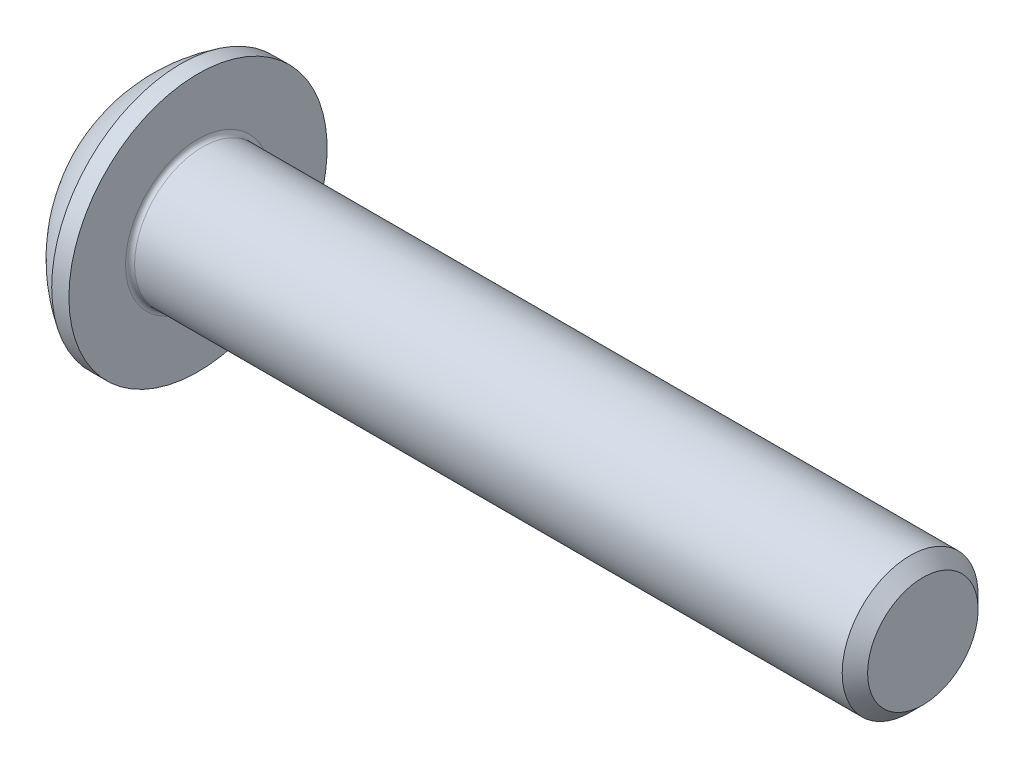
from build123d import *

# Parameters (mm, degrees)
FILLET1_R   = 0.1
HEX_2_DEPTH = 1.04


with BuildPart() as part:
    # BodySke → BaseBody (revolve)
    with BuildSketch(Plane.XY, mode=Mode.PRIVATE) as basebody_sk:
        with BuildLine():
            Line((17.65, 0), (17.65, 1.2195))
            Line((17.65, 1.2195), (17.3695, 1.5))
            Line((17.3695, 1.5), (1.65, 1.5))
            Line((1.65, 1.5), (1.65, 2.85))
            Line((1.65, 2.85), (1.27, 2.85))
            ThreePointArc((1.27, 2.85), (0.53140404, 2.229827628), (0, 1.425))
            Line((0, 1.425), (0, 0))
            Line((0, 0), (17.65, 0))
        make_face()
    revolve(basebody_sk.sketch.rotate(Axis((0, 0, 0), (1, 0, 0)), 90), axis=Axis((0, 0, 0), (1, 0, 0)))

    # Fillet1
    fillet1_edges = [part.edges().sort_by_distance(p)[0] for p in [
        (1.65, 0, -1.5),
    ]]
    fillet(fillet1_edges, radius=FILLET1_R)

    # Sketch2 → PreBroach (revolve, cut)
    with BuildSketch(Plane.XY, mode=Mode.PRIVATE) as prebroach_sk:
        Polygon((0, 1), (1.04, 1), (1.617350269, 0), (0, 0), align=None)
    revolve(prebroach_sk.sketch.rotate(Axis((0, 0, 0), (1, 0, 0)), 90), axis=Axis((0, 0, 0), (1, 0, 0)), mode=Mode.SUBTRACT)

    # Sketch3 → Hex 2 (cut)
    with BuildSketch(Plane(origin=(0, 0, 0), x_dir=(0, 0, -1), z_dir=(1, 0, 0))):
        Polygon((-1, -0.577350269), (-1, 0.577350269), (0, 1.154700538), (1, 0.577350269), (1, -0.577350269), (0, -1.154700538), align=None)
    extrude(amount=HEX_2_DEPTH, mode=Mode.SUBTRACT)


solid = part.part
